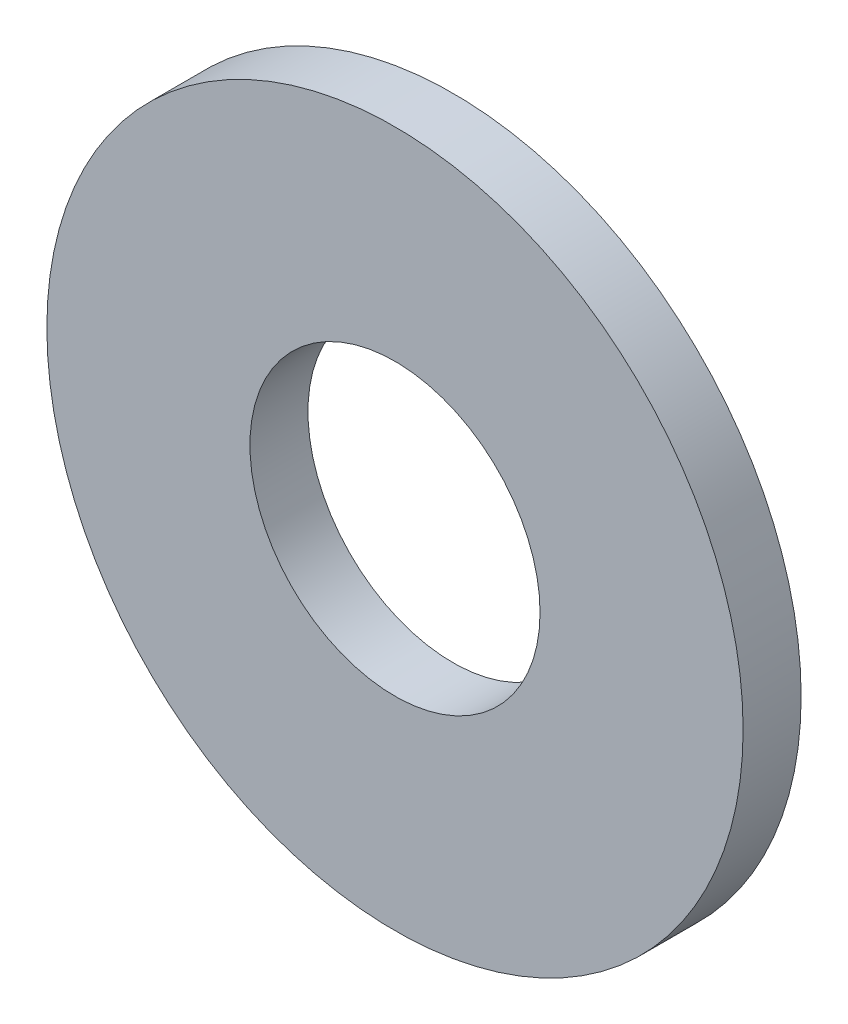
ISO-10303-21;
HEADER;
FILE_DESCRIPTION(('STEP AP214'),'2;1');
FILE_NAME('part.step','',(''),(''),'','','');
FILE_SCHEMA(('AUTOMOTIVE_DESIGN { 1 0 10303 214 1 1 1 1 }'));
ENDSEC;
DATA;
#1=APPLICATION_CONTEXT('core data for automotive mechanical design processes');
#2=APPLICATION_PROTOCOL_DEFINITION('international standard','automotive_design',2000,#1);
#3=PRODUCT_CONTEXT('',#1,'mechanical');
#4=PRODUCT('Part','Part','',(#3));
#5=PRODUCT_RELATED_PRODUCT_CATEGORY('part','',(#4));
#6=PRODUCT_DEFINITION_FORMATION('','',#4);
#7=PRODUCT_DEFINITION_CONTEXT('part definition',#1,'design');
#8=PRODUCT_DEFINITION('design','',#6,#7);
#9=PRODUCT_DEFINITION_SHAPE('','',#8);
#10=(LENGTH_UNIT() NAMED_UNIT(*) SI_UNIT(.MILLI.,.METRE.));
#11=(NAMED_UNIT(*) PLANE_ANGLE_UNIT() SI_UNIT($,.RADIAN.));
#12=(NAMED_UNIT(*) SI_UNIT($,.STERADIAN.) SOLID_ANGLE_UNIT());
#13=UNCERTAINTY_MEASURE_WITH_UNIT(LENGTH_MEASURE(1.E-05),#10,'distance_accuracy_value','');
#14=(GEOMETRIC_REPRESENTATION_CONTEXT(3) GLOBAL_UNCERTAINTY_ASSIGNED_CONTEXT((#13)) GLOBAL_UNIT_ASSIGNED_CONTEXT((#10,
#11,#12)) REPRESENTATION_CONTEXT('',''));
#15=CARTESIAN_POINT('',(0.,0.,0.));
#16=DIRECTION('',(0.,0.,1.));
#17=DIRECTION('',(1.,0.,0.));
#18=AXIS2_PLACEMENT_3D('',#15,#16,#17);
#19=CARTESIAN_POINT('',(0.,0.,1.5875));
#20=DIRECTION('',(0.,0.,1.));
#21=DIRECTION('',(1.,0.,0.));
#22=AXIS2_PLACEMENT_3D('',#19,#20,#21);
#23=PLANE('',#22);
#24=CARTESIAN_POINT('',(0.,0.,1.5875));
#25=DIRECTION('',(0.,0.,1.));
#26=DIRECTION('',(1.,0.,0.));
#27=AXIS2_PLACEMENT_3D('',#24,#25,#26);
#28=CIRCLE('',#27,9.525);
#29=CARTESIAN_POINT('',(9.525,0.,1.5875));
#30=VERTEX_POINT('',#29);
#31=EDGE_CURVE('E10',#30,#30,#28,.T.);
#32=ORIENTED_EDGE('',*,*,#31,.T.);
#33=EDGE_LOOP('',(#32));
#34=FACE_BOUND('',#33,.T.);
#35=CARTESIAN_POINT('',(0.,0.,1.5875));
#36=DIRECTION('',(0.,0.,1.));
#37=DIRECTION('',(1.,0.,0.));
#38=AXIS2_PLACEMENT_3D('',#35,#36,#37);
#39=CIRCLE('',#38,3.96875);
#40=CARTESIAN_POINT('',(3.96875,0.,1.5875));
#41=VERTEX_POINT('',#40);
#42=EDGE_CURVE('E41',#41,#41,#39,.T.);
#43=ORIENTED_EDGE('',*,*,#42,.F.);
#44=EDGE_LOOP('',(#43));
#45=FACE_BOUND('',#44,.T.);
#46=ADVANCED_FACE('F30',(#34,#45),#23,.T.);
#47=CARTESIAN_POINT('',(0.,0.,0.));
#48=DIRECTION('',(0.,0.,1.));
#49=DIRECTION('',(1.,0.,0.));
#50=AXIS2_PLACEMENT_3D('',#47,#48,#49);
#51=PLANE('',#50);
#52=CARTESIAN_POINT('',(0.,0.,0.));
#53=DIRECTION('',(0.,0.,1.));
#54=DIRECTION('',(1.,0.,0.));
#55=AXIS2_PLACEMENT_3D('',#52,#53,#54);
#56=CIRCLE('',#55,9.525);
#57=CARTESIAN_POINT('',(9.525,0.,0.));
#58=VERTEX_POINT('',#57);
#59=EDGE_CURVE('E34',#58,#58,#56,.T.);
#60=ORIENTED_EDGE('',*,*,#59,.F.);
#61=EDGE_LOOP('',(#60));
#62=FACE_BOUND('',#61,.T.);
#63=CARTESIAN_POINT('',(0.,0.,0.));
#64=DIRECTION('',(0.,0.,1.));
#65=DIRECTION('',(1.,0.,0.));
#66=AXIS2_PLACEMENT_3D('',#63,#64,#65);
#67=CIRCLE('',#66,3.96875);
#68=CARTESIAN_POINT('',(3.96875,0.,0.));
#69=VERTEX_POINT('',#68);
#70=EDGE_CURVE('E43',#69,#69,#67,.T.);
#71=ORIENTED_EDGE('',*,*,#70,.T.);
#72=EDGE_LOOP('',(#71));
#73=FACE_BOUND('',#72,.T.);
#74=ADVANCED_FACE('F53',(#62,#73),#51,.F.);
#75=CARTESIAN_POINT('',(0.,0.,1.5875));
#76=DIRECTION('',(0.,0.,-1.));
#77=DIRECTION('',(-1.,0.,0.));
#78=AXIS2_PLACEMENT_3D('',#75,#76,#77);
#79=CYLINDRICAL_SURFACE('',#78,9.525);
#80=ORIENTED_EDGE('',*,*,#31,.F.);
#81=EDGE_LOOP('',(#80));
#82=FACE_BOUND('',#81,.T.);
#83=ORIENTED_EDGE('',*,*,#59,.T.);
#84=EDGE_LOOP('',(#83));
#85=FACE_BOUND('',#84,.T.);
#86=ADVANCED_FACE('F32',(#82,#85),#79,.T.);
#87=CARTESIAN_POINT('',(0.,0.,1.5875));
#88=DIRECTION('',(0.,0.,-1.));
#89=DIRECTION('',(-1.,0.,0.));
#90=AXIS2_PLACEMENT_3D('',#87,#88,#89);
#91=CYLINDRICAL_SURFACE('',#90,3.96875);
#92=ORIENTED_EDGE('',*,*,#42,.T.);
#93=EDGE_LOOP('',(#92));
#94=FACE_BOUND('',#93,.T.);
#95=ORIENTED_EDGE('',*,*,#70,.F.);
#96=EDGE_LOOP('',(#95));
#97=FACE_BOUND('',#96,.T.);
#98=ADVANCED_FACE('F49',(#94,#97),#91,.F.);
#99=CLOSED_SHELL('',(#46,#74,#86,#98));
#100=MANIFOLD_SOLID_BREP('B2',#99);
#101=ADVANCED_BREP_SHAPE_REPRESENTATION('',(#18,#100),#14);
#102=SHAPE_DEFINITION_REPRESENTATION(#9,#101);
ENDSEC;
END-ISO-10303-21;
